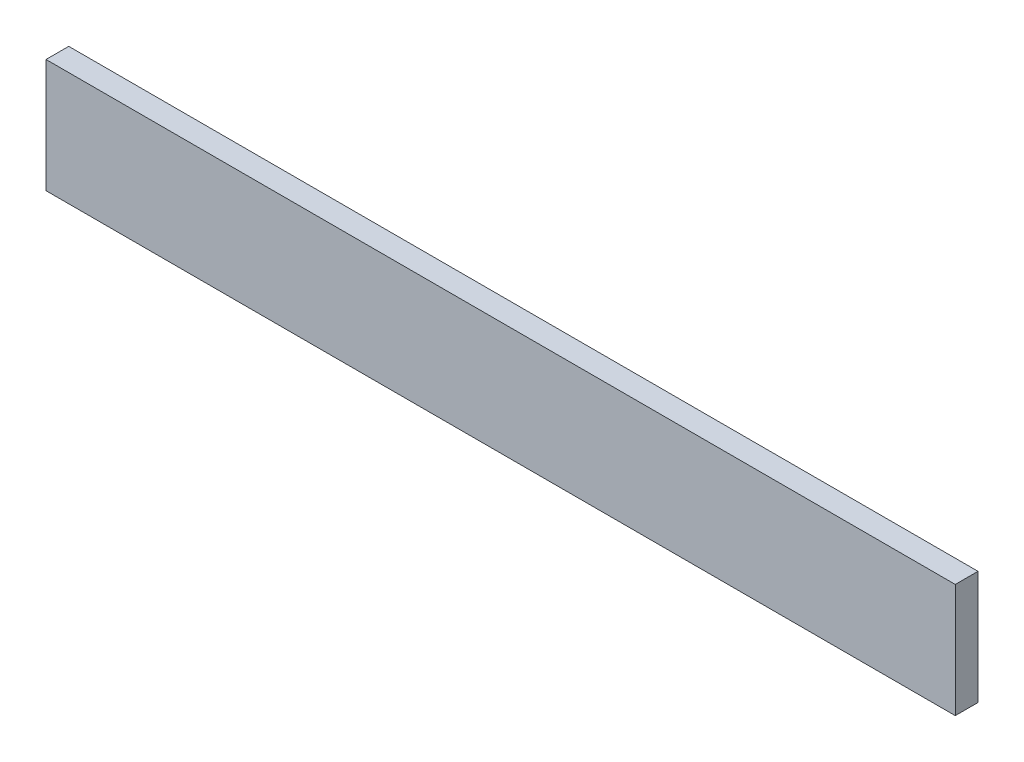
from build123d import *

# Parameters (mm, degrees)
SKETCH1_W      = 101.6
SKETCH1_H      = 2.54
EXTRUDE1_DEPTH = 12.7


with BuildPart() as part:
    # Sketch1 → Extrude1 (new body)
    with BuildSketch(Plane(origin=(0, 0, 0), x_dir=(1, 0, 0), z_dir=(0, 1, 0))):
        with Locations((50.8, 1.27)):
            Rectangle(SKETCH1_W, SKETCH1_H)
    extrude(amount=EXTRUDE1_DEPTH)


solid = part.part
